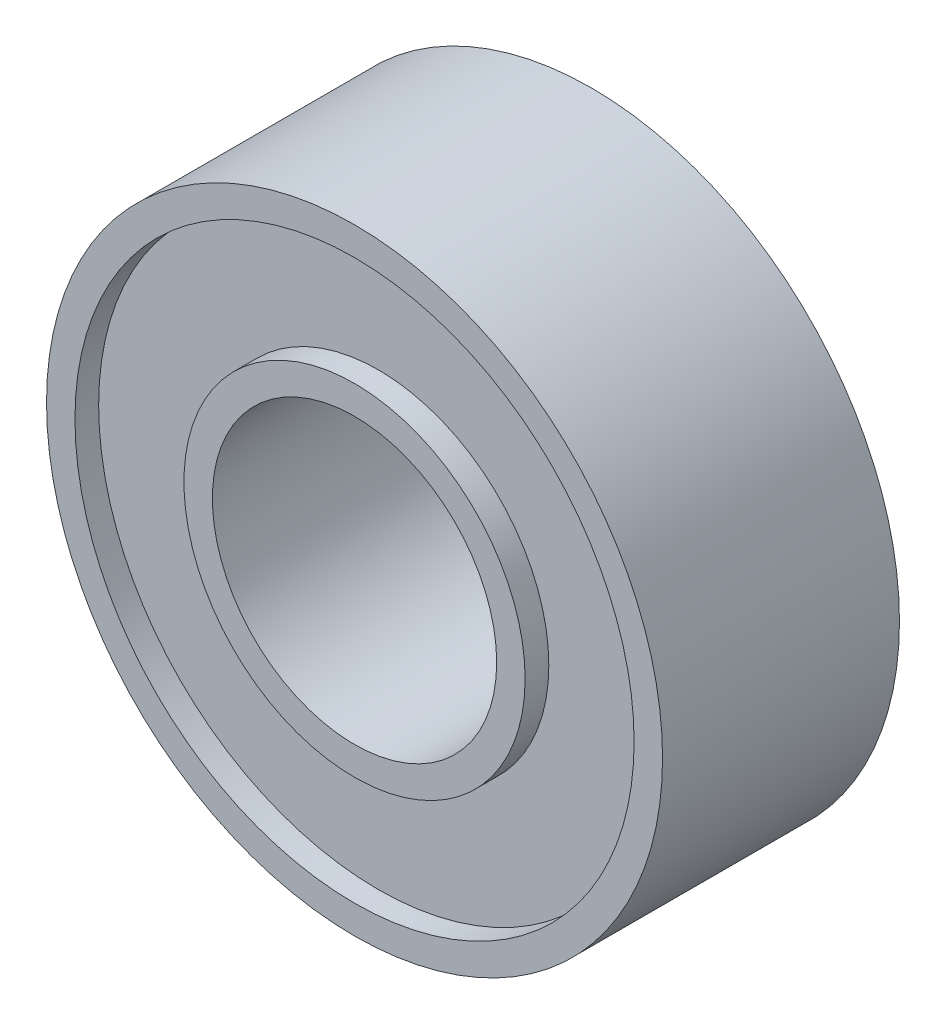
ISO-10303-21;
HEADER;
FILE_DESCRIPTION(('STEP AP214'),'2;1');
FILE_NAME('part.step','',(''),(''),'','','');
FILE_SCHEMA(('AUTOMOTIVE_DESIGN { 1 0 10303 214 1 1 1 1 }'));
ENDSEC;
DATA;
#1=APPLICATION_CONTEXT('core data for automotive mechanical design processes');
#2=APPLICATION_PROTOCOL_DEFINITION('international standard','automotive_design',2000,#1);
#3=PRODUCT_CONTEXT('',#1,'mechanical');
#4=PRODUCT('Part','Part','',(#3));
#5=PRODUCT_RELATED_PRODUCT_CATEGORY('part','',(#4));
#6=PRODUCT_DEFINITION_FORMATION('','',#4);
#7=PRODUCT_DEFINITION_CONTEXT('part definition',#1,'design');
#8=PRODUCT_DEFINITION('design','',#6,#7);
#9=PRODUCT_DEFINITION_SHAPE('','',#8);
#10=(LENGTH_UNIT() NAMED_UNIT(*) SI_UNIT(.MILLI.,.METRE.));
#11=(NAMED_UNIT(*) PLANE_ANGLE_UNIT() SI_UNIT($,.RADIAN.));
#12=(NAMED_UNIT(*) SI_UNIT($,.STERADIAN.) SOLID_ANGLE_UNIT());
#13=UNCERTAINTY_MEASURE_WITH_UNIT(LENGTH_MEASURE(1.E-05),#10,'distance_accuracy_value','');
#14=(GEOMETRIC_REPRESENTATION_CONTEXT(3) GLOBAL_UNCERTAINTY_ASSIGNED_CONTEXT((#13)) GLOBAL_UNIT_ASSIGNED_CONTEXT((#10,
#11,#12)) REPRESENTATION_CONTEXT('',''));
#15=CARTESIAN_POINT('',(0.,0.,0.));
#16=DIRECTION('',(0.,0.,1.));
#17=DIRECTION('',(1.,0.,0.));
#18=AXIS2_PLACEMENT_3D('',#15,#16,#17);
#19=CARTESIAN_POINT('',(0.,0.,0.));
#20=DIRECTION('',(0.,0.,1.));
#21=DIRECTION('',(1.,0.,0.));
#22=AXIS2_PLACEMENT_3D('',#19,#20,#21);
#23=PLANE('',#22);
#24=CARTESIAN_POINT('',(0.,0.,0.));
#25=DIRECTION('',(0.,0.,1.));
#26=DIRECTION('',(1.,0.,0.));
#27=AXIS2_PLACEMENT_3D('',#24,#25,#26);
#28=CIRCLE('',#27,3.);
#29=CARTESIAN_POINT('',(3.,0.,0.));
#30=VERTEX_POINT('',#29);
#31=EDGE_CURVE('E29',#30,#30,#28,.T.);
#32=ORIENTED_EDGE('',*,*,#31,.T.);
#33=EDGE_LOOP('',(#32));
#34=FACE_BOUND('',#33,.T.);
#35=CARTESIAN_POINT('',(0.,0.,0.));
#36=DIRECTION('',(0.,0.,-1.));
#37=DIRECTION('',(-1.,0.,0.));
#38=AXIS2_PLACEMENT_3D('',#35,#36,#37);
#39=CIRCLE('',#38,3.6);
#40=CARTESIAN_POINT('',(-3.6,0.,0.));
#41=VERTEX_POINT('',#40);
#42=EDGE_CURVE('E53',#41,#41,#39,.T.);
#43=ORIENTED_EDGE('',*,*,#42,.T.);
#44=EDGE_LOOP('',(#43));
#45=FACE_BOUND('',#44,.T.);
#46=ADVANCED_FACE('F16',(#34,#45),#23,.F.);
#47=CARTESIAN_POINT('',(0.,0.,5.));
#48=DIRECTION('',(0.,0.,1.));
#49=DIRECTION('',(1.,0.,0.));
#50=AXIS2_PLACEMENT_3D('',#47,#48,#49);
#51=PLANE('',#50);
#52=CARTESIAN_POINT('',(0.,0.,5.));
#53=DIRECTION('',(0.,0.,1.));
#54=DIRECTION('',(1.,0.,0.));
#55=AXIS2_PLACEMENT_3D('',#52,#53,#54);
#56=CIRCLE('',#55,3.);
#57=CARTESIAN_POINT('',(3.,0.,5.));
#58=VERTEX_POINT('',#57);
#59=EDGE_CURVE('E27',#58,#58,#56,.T.);
#60=ORIENTED_EDGE('',*,*,#59,.F.);
#61=EDGE_LOOP('',(#60));
#62=FACE_BOUND('',#61,.T.);
#63=CARTESIAN_POINT('',(0.,0.,5.));
#64=DIRECTION('',(0.,0.,1.));
#65=DIRECTION('',(1.,0.,0.));
#66=AXIS2_PLACEMENT_3D('',#63,#64,#65);
#67=CIRCLE('',#66,3.6);
#68=CARTESIAN_POINT('',(3.6,0.,5.));
#69=VERTEX_POINT('',#68);
#70=EDGE_CURVE('E41',#69,#69,#67,.T.);
#71=ORIENTED_EDGE('',*,*,#70,.T.);
#72=EDGE_LOOP('',(#71));
#73=FACE_BOUND('',#72,.T.);
#74=ADVANCED_FACE('F93',(#62,#73),#51,.T.);
#75=CARTESIAN_POINT('',(0.,0.,5.));
#76=DIRECTION('',(0.,0.,1.));
#77=DIRECTION('',(1.,0.,0.));
#78=AXIS2_PLACEMENT_3D('',#75,#76,#77);
#79=CIRCLE('',#78,5.9);
#80=CARTESIAN_POINT('',(5.9,0.,5.));
#81=VERTEX_POINT('',#80);
#82=EDGE_CURVE('E35',#81,#81,#79,.T.);
#83=ORIENTED_EDGE('',*,*,#82,.F.);
#84=EDGE_LOOP('',(#83));
#85=FACE_BOUND('',#84,.T.);
#86=CARTESIAN_POINT('',(0.,0.,5.));
#87=DIRECTION('',(0.,0.,1.));
#88=DIRECTION('',(1.,0.,0.));
#89=AXIS2_PLACEMENT_3D('',#86,#87,#88);
#90=CIRCLE('',#89,6.5);
#91=CARTESIAN_POINT('',(6.5,0.,5.));
#92=VERTEX_POINT('',#91);
#93=EDGE_CURVE('E10',#92,#92,#90,.T.);
#94=ORIENTED_EDGE('',*,*,#93,.T.);
#95=EDGE_LOOP('',(#94));
#96=FACE_BOUND('',#95,.T.);
#97=ADVANCED_FACE('F78',(#85,#96),#51,.T.);
#98=CARTESIAN_POINT('',(0.,0.,0.));
#99=DIRECTION('',(0.,0.,-1.));
#100=DIRECTION('',(-1.,0.,0.));
#101=AXIS2_PLACEMENT_3D('',#98,#99,#100);
#102=CIRCLE('',#101,5.9);
#103=CARTESIAN_POINT('',(-5.9,0.,0.));
#104=VERTEX_POINT('',#103);
#105=EDGE_CURVE('E47',#104,#104,#102,.T.);
#106=ORIENTED_EDGE('',*,*,#105,.F.);
#107=EDGE_LOOP('',(#106));
#108=FACE_BOUND('',#107,.T.);
#109=CARTESIAN_POINT('',(0.,0.,0.));
#110=DIRECTION('',(0.,0.,1.));
#111=DIRECTION('',(1.,0.,0.));
#112=AXIS2_PLACEMENT_3D('',#109,#110,#111);
#113=CIRCLE('',#112,6.5);
#114=CARTESIAN_POINT('',(6.5,0.,0.));
#115=VERTEX_POINT('',#114);
#116=EDGE_CURVE('E20',#115,#115,#113,.T.);
#117=ORIENTED_EDGE('',*,*,#116,.F.);
#118=EDGE_LOOP('',(#117));
#119=FACE_BOUND('',#118,.T.);
#120=ADVANCED_FACE('F75',(#108,#119),#23,.F.);
#121=CARTESIAN_POINT('',(0.,0.,5.));
#122=DIRECTION('',(0.,0.,-1.));
#123=DIRECTION('',(-1.,0.,0.));
#124=AXIS2_PLACEMENT_3D('',#121,#122,#123);
#125=CYLINDRICAL_SURFACE('',#124,6.5);
#126=ORIENTED_EDGE('',*,*,#93,.F.);
#127=EDGE_LOOP('',(#126));
#128=FACE_BOUND('',#127,.T.);
#129=ORIENTED_EDGE('',*,*,#116,.T.);
#130=EDGE_LOOP('',(#129));
#131=FACE_BOUND('',#130,.T.);
#132=ADVANCED_FACE('F18',(#128,#131),#125,.T.);
#133=CARTESIAN_POINT('',(0.,0.,5.));
#134=DIRECTION('',(0.,0.,-1.));
#135=DIRECTION('',(-1.,0.,0.));
#136=AXIS2_PLACEMENT_3D('',#133,#134,#135);
#137=CYLINDRICAL_SURFACE('',#136,3.);
#138=ORIENTED_EDGE('',*,*,#59,.T.);
#139=EDGE_LOOP('',(#138));
#140=FACE_BOUND('',#139,.T.);
#141=ORIENTED_EDGE('',*,*,#31,.F.);
#142=EDGE_LOOP('',(#141));
#143=FACE_BOUND('',#142,.T.);
#144=ADVANCED_FACE('F82',(#140,#143),#137,.F.);
#145=CARTESIAN_POINT('',(0.,0.,4.5));
#146=DIRECTION('',(0.,0.,1.));
#147=DIRECTION('',(1.,0.,0.));
#148=AXIS2_PLACEMENT_3D('',#145,#146,#147);
#149=CYLINDRICAL_SURFACE('',#148,5.9);
#150=CARTESIAN_POINT('',(0.,0.,4.5));
#151=DIRECTION('',(0.,0.,1.));
#152=DIRECTION('',(1.,0.,0.));
#153=AXIS2_PLACEMENT_3D('',#150,#151,#152);
#154=CIRCLE('',#153,5.9);
#155=CARTESIAN_POINT('',(5.9,0.,4.5));
#156=VERTEX_POINT('',#155);
#157=EDGE_CURVE('E32',#156,#156,#154,.T.);
#158=ORIENTED_EDGE('',*,*,#157,.F.);
#159=EDGE_LOOP('',(#158));
#160=FACE_BOUND('',#159,.T.);
#161=ORIENTED_EDGE('',*,*,#82,.T.);
#162=EDGE_LOOP('',(#161));
#163=FACE_BOUND('',#162,.T.);
#164=ADVANCED_FACE('F89',(#160,#163),#149,.F.);
#165=CARTESIAN_POINT('',(0.,0.,4.5));
#166=DIRECTION('',(0.,0.,1.));
#167=DIRECTION('',(1.,0.,0.));
#168=AXIS2_PLACEMENT_3D('',#165,#166,#167);
#169=PLANE('',#168);
#170=CARTESIAN_POINT('',(0.,0.,4.5));
#171=DIRECTION('',(0.,0.,1.));
#172=DIRECTION('',(1.,0.,0.));
#173=AXIS2_PLACEMENT_3D('',#170,#171,#172);
#174=CIRCLE('',#173,3.6);
#175=CARTESIAN_POINT('',(3.6,0.,4.5));
#176=VERTEX_POINT('',#175);
#177=EDGE_CURVE('E38',#176,#176,#174,.T.);
#178=ORIENTED_EDGE('',*,*,#177,.F.);
#179=EDGE_LOOP('',(#178));
#180=FACE_BOUND('',#179,.T.);
#181=ORIENTED_EDGE('',*,*,#157,.T.);
#182=EDGE_LOOP('',(#181));
#183=FACE_BOUND('',#182,.T.);
#184=ADVANCED_FACE('F107',(#180,#183),#169,.T.);
#185=CARTESIAN_POINT('',(0.,0.,4.5));
#186=DIRECTION('',(0.,0.,1.));
#187=DIRECTION('',(1.,0.,0.));
#188=AXIS2_PLACEMENT_3D('',#185,#186,#187);
#189=CYLINDRICAL_SURFACE('',#188,3.6);
#190=ORIENTED_EDGE('',*,*,#177,.T.);
#191=EDGE_LOOP('',(#190));
#192=FACE_BOUND('',#191,.T.);
#193=ORIENTED_EDGE('',*,*,#70,.F.);
#194=EDGE_LOOP('',(#193));
#195=FACE_BOUND('',#194,.T.);
#196=ADVANCED_FACE('F71',(#192,#195),#189,.T.);
#197=CARTESIAN_POINT('',(0.,0.,0.5));
#198=DIRECTION('',(0.,0.,-1.));
#199=DIRECTION('',(-1.,0.,0.));
#200=AXIS2_PLACEMENT_3D('',#197,#198,#199);
#201=CYLINDRICAL_SURFACE('',#200,5.9);
#202=CARTESIAN_POINT('',(0.,0.,0.5));
#203=DIRECTION('',(0.,0.,-1.));
#204=DIRECTION('',(-1.,0.,0.));
#205=AXIS2_PLACEMENT_3D('',#202,#203,#204);
#206=CIRCLE('',#205,5.9);
#207=CARTESIAN_POINT('',(-5.9,0.,0.5));
#208=VERTEX_POINT('',#207);
#209=EDGE_CURVE('E44',#208,#208,#206,.T.);
#210=ORIENTED_EDGE('',*,*,#209,.F.);
#211=EDGE_LOOP('',(#210));
#212=FACE_BOUND('',#211,.T.);
#213=ORIENTED_EDGE('',*,*,#105,.T.);
#214=EDGE_LOOP('',(#213));
#215=FACE_BOUND('',#214,.T.);
#216=ADVANCED_FACE('F65',(#212,#215),#201,.F.);
#217=CARTESIAN_POINT('',(0.,0.,0.5));
#218=DIRECTION('',(0.,0.,-1.));
#219=DIRECTION('',(-1.,0.,0.));
#220=AXIS2_PLACEMENT_3D('',#217,#218,#219);
#221=PLANE('',#220);
#222=CARTESIAN_POINT('',(0.,0.,0.5));
#223=DIRECTION('',(0.,0.,-1.));
#224=DIRECTION('',(-1.,0.,0.));
#225=AXIS2_PLACEMENT_3D('',#222,#223,#224);
#226=CIRCLE('',#225,3.6);
#227=CARTESIAN_POINT('',(-3.6,0.,0.5));
#228=VERTEX_POINT('',#227);
#229=EDGE_CURVE('E50',#228,#228,#226,.T.);
#230=ORIENTED_EDGE('',*,*,#229,.F.);
#231=EDGE_LOOP('',(#230));
#232=FACE_BOUND('',#231,.T.);
#233=ORIENTED_EDGE('',*,*,#209,.T.);
#234=EDGE_LOOP('',(#233));
#235=FACE_BOUND('',#234,.T.);
#236=ADVANCED_FACE('F62',(#232,#235),#221,.T.);
#237=CARTESIAN_POINT('',(0.,0.,0.5));
#238=DIRECTION('',(0.,0.,-1.));
#239=DIRECTION('',(-1.,0.,0.));
#240=AXIS2_PLACEMENT_3D('',#237,#238,#239);
#241=CYLINDRICAL_SURFACE('',#240,3.6);
#242=ORIENTED_EDGE('',*,*,#229,.T.);
#243=EDGE_LOOP('',(#242));
#244=FACE_BOUND('',#243,.T.);
#245=ORIENTED_EDGE('',*,*,#42,.F.);
#246=EDGE_LOOP('',(#245));
#247=FACE_BOUND('',#246,.T.);
#248=ADVANCED_FACE('F59',(#244,#247),#241,.T.);
#249=CLOSED_SHELL('',(#46,#74,#97,#120,#132,#144,#164,#184,#196,#216,#236,#248));
#250=MANIFOLD_SOLID_BREP('B1',#249);
#251=ADVANCED_BREP_SHAPE_REPRESENTATION('',(#18,#250),#14);
#252=SHAPE_DEFINITION_REPRESENTATION(#9,#251);
ENDSEC;
END-ISO-10303-21;
